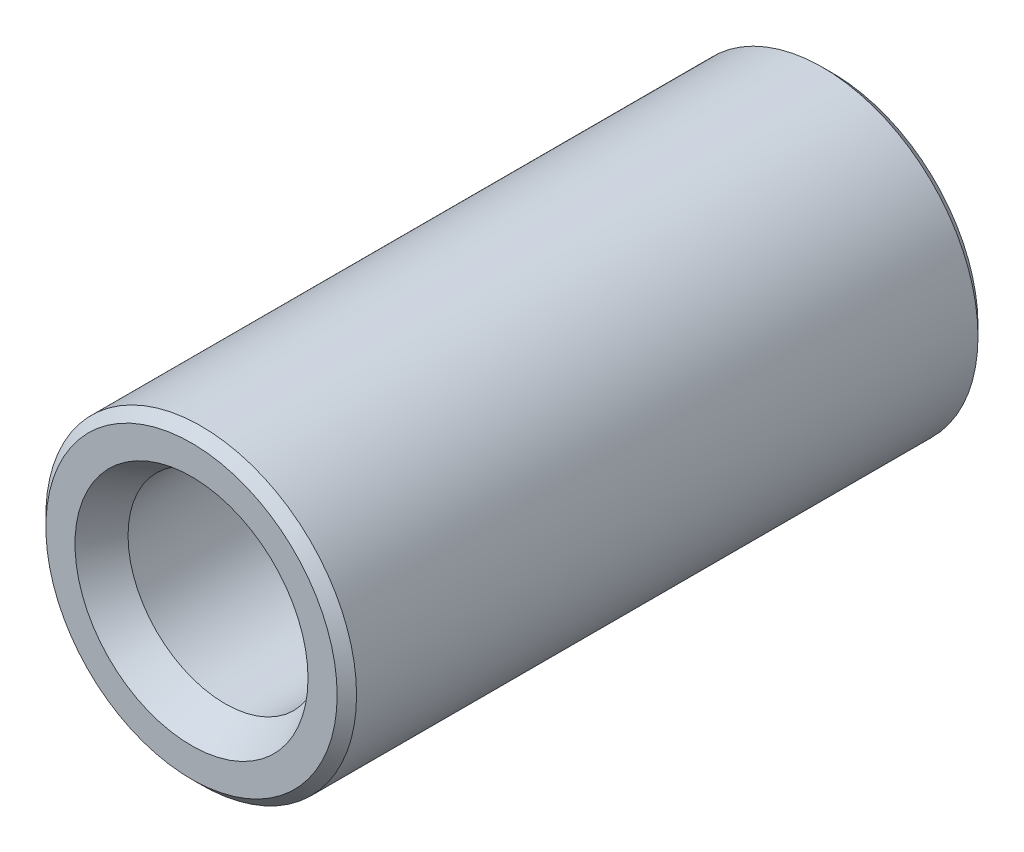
ISO-10303-21;
HEADER;
FILE_DESCRIPTION(('STEP AP214'),'2;1');
FILE_NAME('part.step','',(''),(''),'','','');
FILE_SCHEMA(('AUTOMOTIVE_DESIGN { 1 0 10303 214 1 1 1 1 }'));
ENDSEC;
DATA;
#1=APPLICATION_CONTEXT('core data for automotive mechanical design processes');
#2=APPLICATION_PROTOCOL_DEFINITION('international standard','automotive_design',2000,#1);
#3=PRODUCT_CONTEXT('',#1,'mechanical');
#4=PRODUCT('Part','Part','',(#3));
#5=PRODUCT_RELATED_PRODUCT_CATEGORY('part','',(#4));
#6=PRODUCT_DEFINITION_FORMATION('','',#4);
#7=PRODUCT_DEFINITION_CONTEXT('part definition',#1,'design');
#8=PRODUCT_DEFINITION('design','',#6,#7);
#9=PRODUCT_DEFINITION_SHAPE('','',#8);
#10=(LENGTH_UNIT() NAMED_UNIT(*) SI_UNIT(.MILLI.,.METRE.));
#11=(NAMED_UNIT(*) PLANE_ANGLE_UNIT() SI_UNIT($,.RADIAN.));
#12=(NAMED_UNIT(*) SI_UNIT($,.STERADIAN.) SOLID_ANGLE_UNIT());
#13=UNCERTAINTY_MEASURE_WITH_UNIT(LENGTH_MEASURE(1.E-05),#10,'distance_accuracy_value','');
#14=(GEOMETRIC_REPRESENTATION_CONTEXT(3) GLOBAL_UNCERTAINTY_ASSIGNED_CONTEXT((#13)) GLOBAL_UNIT_ASSIGNED_CONTEXT((#10,
#11,#12)) REPRESENTATION_CONTEXT('',''));
#15=CARTESIAN_POINT('',(0.,0.,0.));
#16=DIRECTION('',(0.,0.,1.));
#17=DIRECTION('',(1.,0.,0.));
#18=AXIS2_PLACEMENT_3D('',#15,#16,#17);
#19=CARTESIAN_POINT('',(0.,0.,33.));
#20=DIRECTION('',(0.,0.,1.));
#21=DIRECTION('',(1.,0.,0.));
#22=AXIS2_PLACEMENT_3D('',#19,#20,#21);
#23=PLANE('',#22);
#24=CARTESIAN_POINT('',(0.,0.,33.));
#25=DIRECTION('',(0.,0.,1.));
#26=DIRECTION('',(1.,0.,0.));
#27=AXIS2_PLACEMENT_3D('',#24,#25,#26);
#28=CIRCLE('',#27,7.5);
#29=CARTESIAN_POINT('',(7.5,0.,33.));
#30=VERTEX_POINT('',#29);
#31=EDGE_CURVE('E43',#30,#30,#28,.T.);
#32=ORIENTED_EDGE('',*,*,#31,.T.);
#33=EDGE_LOOP('',(#32));
#34=FACE_BOUND('',#33,.T.);
#35=CARTESIAN_POINT('',(0.,0.,33.));
#36=DIRECTION('',(0.,0.,1.));
#37=DIRECTION('',(1.,0.,0.));
#38=AXIS2_PLACEMENT_3D('',#35,#36,#37);
#39=CIRCLE('',#38,6.00000000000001);
#40=CARTESIAN_POINT('',(6.00000000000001,0.,33.));
#41=VERTEX_POINT('',#40);
#42=EDGE_CURVE('E48',#41,#41,#39,.F.);
#43=ORIENTED_EDGE('',*,*,#42,.T.);
#44=EDGE_LOOP('',(#43));
#45=FACE_BOUND('',#44,.T.);
#46=ADVANCED_FACE('F28',(#34,#45),#23,.T.);
#47=CARTESIAN_POINT('',(0.,0.,0.));
#48=DIRECTION('',(0.,0.,1.));
#49=DIRECTION('',(1.,0.,0.));
#50=AXIS2_PLACEMENT_3D('',#47,#48,#49);
#51=PLANE('',#50);
#52=CARTESIAN_POINT('',(0.,0.,0.));
#53=DIRECTION('',(0.,0.,1.));
#54=DIRECTION('',(1.,0.,0.));
#55=AXIS2_PLACEMENT_3D('',#52,#53,#54);
#56=CIRCLE('',#55,7.5);
#57=CARTESIAN_POINT('',(7.5,0.,0.));
#58=VERTEX_POINT('',#57);
#59=EDGE_CURVE('E10',#58,#58,#56,.F.);
#60=ORIENTED_EDGE('',*,*,#59,.T.);
#61=EDGE_LOOP('',(#60));
#62=FACE_BOUND('',#61,.T.);
#63=CARTESIAN_POINT('',(0.,0.,0.));
#64=DIRECTION('',(0.,0.,1.));
#65=DIRECTION('',(1.,0.,0.));
#66=AXIS2_PLACEMENT_3D('',#63,#64,#65);
#67=CIRCLE('',#66,6.00000000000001);
#68=CARTESIAN_POINT('',(6.00000000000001,0.,0.));
#69=VERTEX_POINT('',#68);
#70=EDGE_CURVE('E57',#69,#69,#67,.T.);
#71=ORIENTED_EDGE('',*,*,#70,.T.);
#72=EDGE_LOOP('',(#71));
#73=FACE_BOUND('',#72,.T.);
#74=ADVANCED_FACE('F61',(#62,#73),#51,.F.);
#75=CARTESIAN_POINT('',(0.,0.,33.));
#76=DIRECTION('',(0.,0.,-1.));
#77=DIRECTION('',(-1.,0.,0.));
#78=AXIS2_PLACEMENT_3D('',#75,#76,#77);
#79=CYLINDRICAL_SURFACE('',#78,8.);
#80=CARTESIAN_POINT('',(0.,0.,32.5));
#81=DIRECTION('',(0.,0.,1.));
#82=DIRECTION('',(1.,0.,0.));
#83=AXIS2_PLACEMENT_3D('',#80,#81,#82);
#84=CIRCLE('',#83,8.);
#85=CARTESIAN_POINT('',(8.,0.,32.5));
#86=VERTEX_POINT('',#85);
#87=EDGE_CURVE('E35',#86,#86,#84,.F.);
#88=ORIENTED_EDGE('',*,*,#87,.T.);
#89=EDGE_LOOP('',(#88));
#90=FACE_BOUND('',#89,.T.);
#91=CARTESIAN_POINT('',(0.,0.,0.500000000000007));
#92=DIRECTION('',(0.,0.,1.));
#93=DIRECTION('',(1.,0.,0.));
#94=AXIS2_PLACEMENT_3D('',#91,#92,#93);
#95=CIRCLE('',#94,8.);
#96=CARTESIAN_POINT('',(8.,0.,0.500000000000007));
#97=VERTEX_POINT('',#96);
#98=EDGE_CURVE('E39',#97,#97,#95,.T.);
#99=ORIENTED_EDGE('',*,*,#98,.T.);
#100=EDGE_LOOP('',(#99));
#101=FACE_BOUND('',#100,.T.);
#102=ADVANCED_FACE('F30',(#90,#101),#79,.T.);
#103=CARTESIAN_POINT('',(0.,0.,33.));
#104=DIRECTION('',(0.,0.,-1.));
#105=DIRECTION('',(-1.,0.,0.));
#106=AXIS2_PLACEMENT_3D('',#103,#104,#105);
#107=CYLINDRICAL_SURFACE('',#106,5.);
#108=CARTESIAN_POINT('',(0.,0.,1.73205080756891));
#109=DIRECTION('',(0.,0.,1.));
#110=DIRECTION('',(1.,0.,0.));
#111=AXIS2_PLACEMENT_3D('',#108,#109,#110);
#112=CIRCLE('',#111,5.);
#113=CARTESIAN_POINT('',(5.,0.,1.73205080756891));
#114=VERTEX_POINT('',#113);
#115=EDGE_CURVE('E51',#114,#114,#112,.F.);
#116=ORIENTED_EDGE('',*,*,#115,.T.);
#117=EDGE_LOOP('',(#116));
#118=FACE_BOUND('',#117,.T.);
#119=CARTESIAN_POINT('',(0.,0.,31.2679491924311));
#120=DIRECTION('',(0.,0.,1.));
#121=DIRECTION('',(1.,0.,0.));
#122=AXIS2_PLACEMENT_3D('',#119,#120,#121);
#123=CIRCLE('',#122,5.);
#124=CARTESIAN_POINT('',(5.,0.,31.2679491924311));
#125=VERTEX_POINT('',#124);
#126=EDGE_CURVE('E54',#125,#125,#123,.T.);
#127=ORIENTED_EDGE('',*,*,#126,.T.);
#128=EDGE_LOOP('',(#127));
#129=FACE_BOUND('',#128,.T.);
#130=ADVANCED_FACE('F66',(#118,#129),#107,.F.);
#131=CARTESIAN_POINT('',(0.,0.,0.));
#132=DIRECTION('',(0.,0.,-1.));
#133=DIRECTION('',(-1.,0.,0.));
#134=AXIS2_PLACEMENT_3D('',#131,#132,#133);
#135=CONICAL_SURFACE('',#134,6.00000000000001,0.523598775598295);
#136=ORIENTED_EDGE('',*,*,#115,.F.);
#137=EDGE_LOOP('',(#136));
#138=FACE_BOUND('',#137,.T.);
#139=ORIENTED_EDGE('',*,*,#70,.F.);
#140=EDGE_LOOP('',(#139));
#141=FACE_BOUND('',#140,.T.);
#142=ADVANCED_FACE('F63',(#138,#141),#135,.F.);
#143=CARTESIAN_POINT('',(0.,0.,31.2679491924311));
#144=DIRECTION('',(0.,0.,1.));
#145=DIRECTION('',(1.,0.,0.));
#146=AXIS2_PLACEMENT_3D('',#143,#144,#145);
#147=CONICAL_SURFACE('',#146,5.,0.523598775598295);
#148=ORIENTED_EDGE('',*,*,#42,.F.);
#149=EDGE_LOOP('',(#148));
#150=FACE_BOUND('',#149,.T.);
#151=ORIENTED_EDGE('',*,*,#126,.F.);
#152=EDGE_LOOP('',(#151));
#153=FACE_BOUND('',#152,.T.);
#154=ADVANCED_FACE('F65',(#150,#153),#147,.F.);
#155=CARTESIAN_POINT('',(0.,0.,33.));
#156=DIRECTION('',(0.,0.,-1.));
#157=DIRECTION('',(-1.,0.,0.));
#158=AXIS2_PLACEMENT_3D('',#155,#156,#157);
#159=CONICAL_SURFACE('',#158,7.5,0.785398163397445);
#160=ORIENTED_EDGE('',*,*,#87,.F.);
#161=EDGE_LOOP('',(#160));
#162=FACE_BOUND('',#161,.T.);
#163=ORIENTED_EDGE('',*,*,#31,.F.);
#164=EDGE_LOOP('',(#163));
#165=FACE_BOUND('',#164,.T.);
#166=ADVANCED_FACE('F73',(#162,#165),#159,.T.);
#167=CARTESIAN_POINT('',(0.,0.,0.500000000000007));
#168=DIRECTION('',(0.,0.,1.));
#169=DIRECTION('',(1.,0.,0.));
#170=AXIS2_PLACEMENT_3D('',#167,#168,#169);
#171=CONICAL_SURFACE('',#170,8.,0.785398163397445);
#172=ORIENTED_EDGE('',*,*,#59,.F.);
#173=EDGE_LOOP('',(#172));
#174=FACE_BOUND('',#173,.T.);
#175=ORIENTED_EDGE('',*,*,#98,.F.);
#176=EDGE_LOOP('',(#175));
#177=FACE_BOUND('',#176,.T.);
#178=ADVANCED_FACE('F93',(#174,#177),#171,.T.);
#179=CLOSED_SHELL('',(#46,#74,#102,#130,#142,#154,#166,#178));
#180=MANIFOLD_SOLID_BREP('B2',#179);
#181=ADVANCED_BREP_SHAPE_REPRESENTATION('',(#18,#180),#14);
#182=SHAPE_DEFINITION_REPRESENTATION(#9,#181);
ENDSEC;
END-ISO-10303-21;
